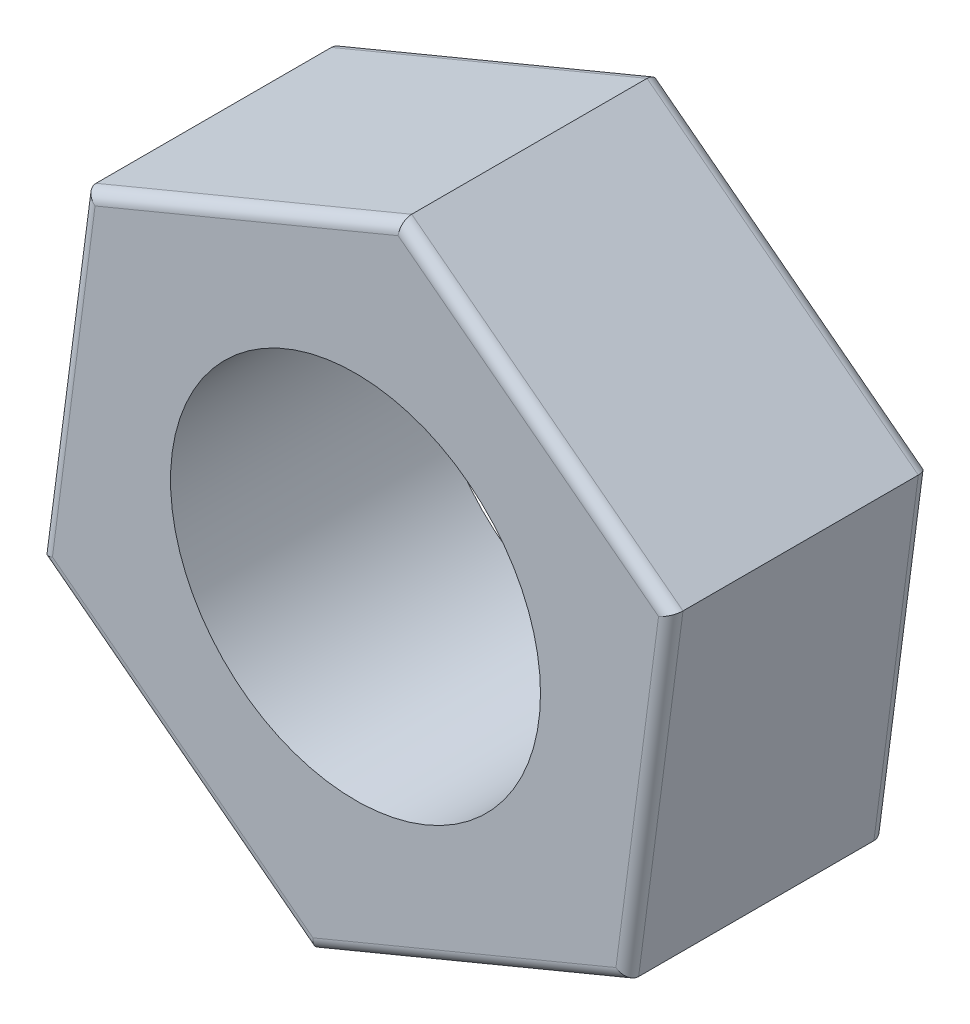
from build123d import *

# Parameters (mm, degrees)
SKETCH1_R           = 3.96875
BOSS_EXTRUDE1_DEPTH = 5.55625
FILLET1_R           = 0.254


with BuildPart() as part:
    # Sketch1 → Boss-Extrude1 (new body)
    with BuildSketch(Plane.XY):
        Polygon((5.820214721, -4.459645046), (6.772273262, 2.810631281), (0.952058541, 7.270276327), (-5.820214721, 4.459645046), (-6.772273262, -2.810631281), (-0.952058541, -7.270276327), align=None)
        Circle(SKETCH1_R, mode=Mode.SUBTRACT)
    extrude(amount=BOSS_EXTRUDE1_DEPTH)

    # Fillet1
    fillet1_edges = [part.edges().sort_by_distance(p)[0] for p in [
        (3.862165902, 5.040453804, 5.55625),
        (-2.43407809, 5.864960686, 5.55625),
        (-6.296243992, 0.824506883, 5.55625),
        (-3.862165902, -5.040453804, 5.55625),
        (2.43407809, -5.864960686, 5.55625),
        (-3.862165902, -5.040453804, 0),
        (-6.296243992, 0.824506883, 0),
        (-2.43407809, 5.864960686, 0),
        (6.296243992, -0.824506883, 5.55625),
        (3.862165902, 5.040453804, 0),
        (6.296243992, -0.824506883, 0),
        (2.43407809, -5.864960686, 0),
    ]]
    fillet(fillet1_edges, radius=FILLET1_R)


solid = part.part
